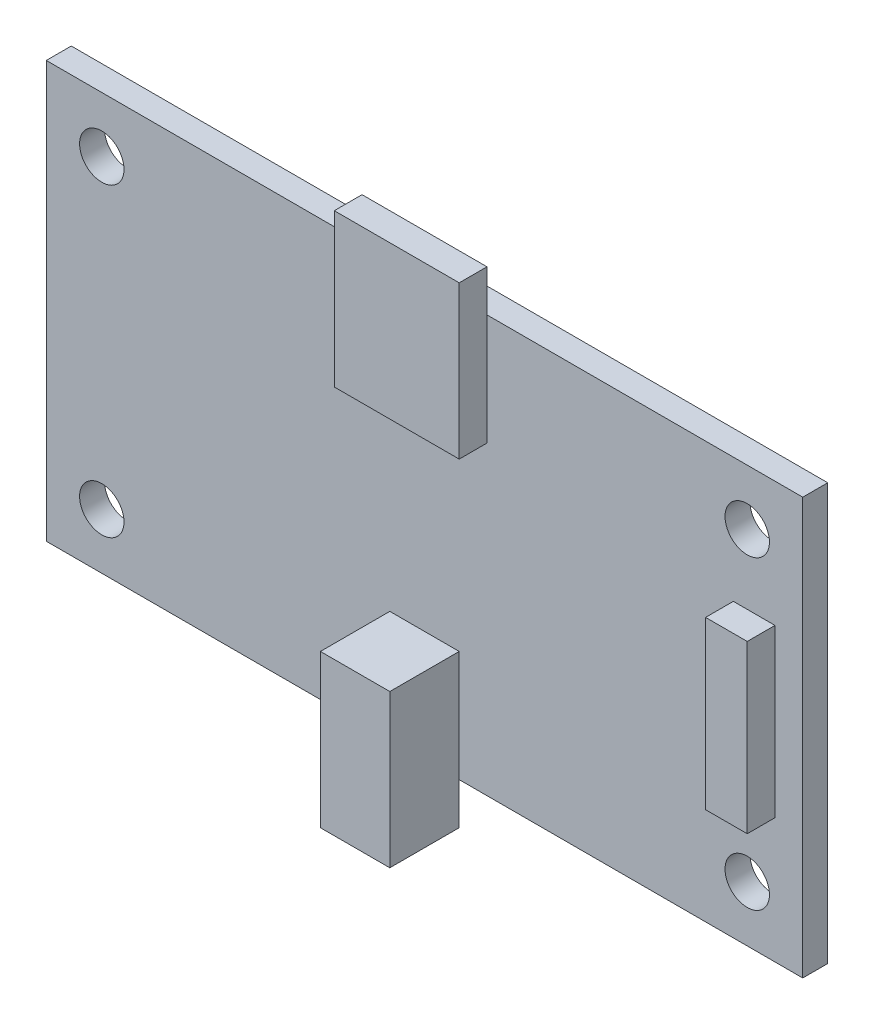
from build123d import *

# Parameters (mm, degrees)
ESQUISSE1_W             = 54.5
ESQUISSE1_H             = 30
BOSS_EXTRU_1_DEPTH      = 1.8
ESQUISSE2_W             = 5
ESQUISSE2_H             = 11
BOSS_EXTRU_2_DEPTH      = 5
ESQUISSE3_W             = 9
ESQUISSE3_H             = 11
ESQUISSE3_W_2           = 3
ESQUISSE3_H_2           = 12
BOSS_EXTRU_3_DEPTH      = 2
ENL_V_MAT_EXTRU_1_REACH = 65.908
ESQUISSE4_R             = 1.6


with BuildPart() as part:
    # Esquisse1 → Boss.-Extru.1 (new body)
    with BuildSketch(Plane.XY):
        with Locations((27.25, 15)):
            Rectangle(ESQUISSE1_W, ESQUISSE1_H)
    extrude(amount=BOSS_EXTRU_1_DEPTH)

    # Esquisse2 → Boss.-Extru.2 (add)
    with BuildSketch(Plane.XY.offset(1.8)):
        with Locations((27.25, 2.5)):
            Rectangle(ESQUISSE2_W, ESQUISSE2_H)
    extrude(amount=BOSS_EXTRU_2_DEPTH)

    # Esquisse3 → Boss.-Extru.3 (add)
    with BuildSketch(Plane.XY.offset(1.8)):
        with Locations((27.25, 27.5)):
            Rectangle(ESQUISSE3_W, ESQUISSE3_H)
        with Locations((51, 15)):
            Rectangle(ESQUISSE3_W_2, ESQUISSE3_H_2)
    extrude(amount=BOSS_EXTRU_3_DEPTH)

    # Esquisse4 → Enl_v. mat.-Extru.1 (cut, up to next)
    with BuildSketch(Plane.XY.offset(1.8), mode=Mode.PRIVATE) as enl_v_mat_extru_1_sk1:
        with Locations((50.5, 26)):
            Circle(ESQUISSE4_R)
    enl_v_mat_extru_1_tool1 = extrude(enl_v_mat_extru_1_sk1.sketch, amount=-ENL_V_MAT_EXTRU_1_REACH, mode=Mode.PRIVATE) & part.part
    # Esquisse4 → Enl_v. mat.-Extru.1 (cut, up to next)
    with BuildSketch(Plane.XY.offset(1.8), mode=Mode.PRIVATE) as enl_v_mat_extru_1_sk2:
        with Locations((50.5, 4)):
            Circle(ESQUISSE4_R)
    enl_v_mat_extru_1_tool2 = extrude(enl_v_mat_extru_1_sk2.sketch, amount=-ENL_V_MAT_EXTRU_1_REACH, mode=Mode.PRIVATE) & part.part
    # Esquisse4 → Enl_v. mat.-Extru.1 (cut, up to next)
    with BuildSketch(Plane.XY.offset(1.8), mode=Mode.PRIVATE) as enl_v_mat_extru_1_sk3:
        with Locations((4, 4)):
            Circle(ESQUISSE4_R)
    enl_v_mat_extru_1_tool3 = extrude(enl_v_mat_extru_1_sk3.sketch, amount=-ENL_V_MAT_EXTRU_1_REACH, mode=Mode.PRIVATE) & part.part
    # Esquisse4 → Enl_v. mat.-Extru.1 (cut, up to next)
    with BuildSketch(Plane.XY.offset(1.8), mode=Mode.PRIVATE) as enl_v_mat_extru_1_sk4:
        with Locations((4, 26)):
            Circle(ESQUISSE4_R)
    enl_v_mat_extru_1_tool4 = extrude(enl_v_mat_extru_1_sk4.sketch, amount=-ENL_V_MAT_EXTRU_1_REACH, mode=Mode.PRIVATE) & part.part
    add(enl_v_mat_extru_1_tool1.solids().sort_by_distance((50.5, 26, 1.8))[0], mode=Mode.SUBTRACT)
    add(enl_v_mat_extru_1_tool2.solids().sort_by_distance((50.5, 4, 1.8))[0], mode=Mode.SUBTRACT)
    add(enl_v_mat_extru_1_tool3.solids().sort_by_distance((4, 4, 1.8))[0], mode=Mode.SUBTRACT)
    add(enl_v_mat_extru_1_tool4.solids().sort_by_distance((4, 26, 1.8))[0], mode=Mode.SUBTRACT)


solid = part.part
